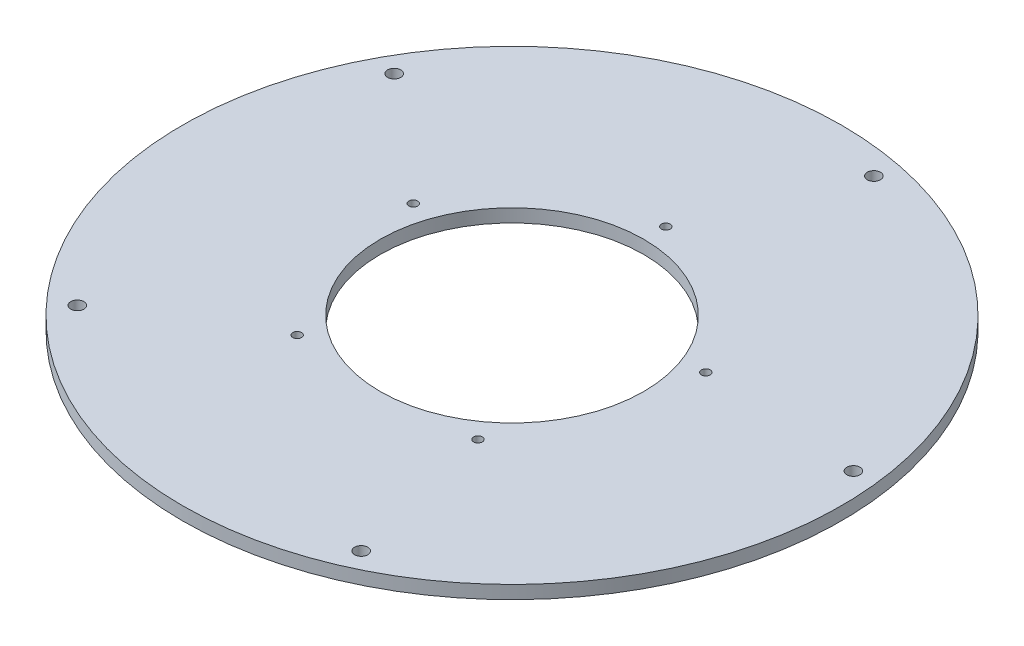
from build123d import *

# Parameters (mm, degrees)
ESQUISSE1_R        = 75
ESQUISSE1_R_2      = 30
ESQUISSE1_R_3      = 1.5
ESQUISSE1_R_4      = 1
BOSS_EXTRU_1_DEPTH = 3


with BuildPart() as part:
    # Esquisse1 → Boss.-Extru.1 (new body)
    with BuildSketch(Plane(origin=(0, 0, 0), x_dir=(1, 0, 0), z_dir=(0, 1, 0))):
        with Locations(Location((0, 0, 0), (0, 0, 270))):
            Circle(ESQUISSE1_R)
        with Locations(Location((0, 0, 0), (0, 0, 270))):
            Circle(ESQUISSE1_R_2, mode=Mode.SUBTRACT)
        with Locations(Location((13.7, 68.646267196, 0), (0, 0, 270))):
            Circle(ESQUISSE1_R_3, mode=Mode.SUBTRACT)
        with Locations(Location((0, 35, 0), (0, 0, 270))):
            Circle(ESQUISSE1_R_4, mode=Mode.SUBTRACT)
        with Locations(Location((69.520012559, 8.183388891, 0), (0, 0, 270))):
            Circle(ESQUISSE1_R_3, mode=Mode.SUBTRACT)
        with Locations(Location((33.28697807, 10.815594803, 0), (0, 0, 270))):
            Circle(ESQUISSE1_R_4, mode=Mode.SUBTRACT)
        with Locations(Location((29.26573066, -63.588654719, 0), (0, 0, 270))):
            Circle(ESQUISSE1_R_3, mode=Mode.SUBTRACT)
        with Locations(Location((20.57248383, -28.315594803, 0), (0, 0, 270))):
            Circle(ESQUISSE1_R_4, mode=Mode.SUBTRACT)
        with Locations(Location((-51.432796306, -47.483338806, 0), (0, 0, 270))):
            Circle(ESQUISSE1_R_3, mode=Mode.SUBTRACT)
        with Locations(Location((-20.57248383, -28.315594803, 0), (0, 0, 270))):
            Circle(ESQUISSE1_R_4, mode=Mode.SUBTRACT)
        with Locations(Location((-61.052946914, 34.242337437, 0), (0, 0, 270))):
            Circle(ESQUISSE1_R_3, mode=Mode.SUBTRACT)
        with Locations(Location((-33.28697807, 10.815594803, 0), (0, 0, 270))):
            Circle(ESQUISSE1_R_4, mode=Mode.SUBTRACT)
    extrude(amount=BOSS_EXTRU_1_DEPTH)


solid = part.part
